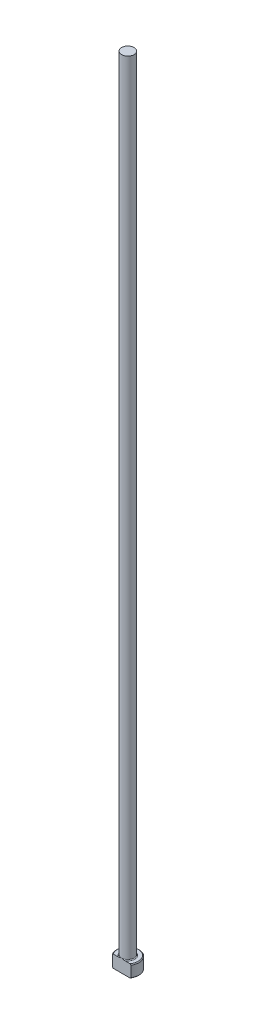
from build123d import *

# Parameters (mm, degrees)
CHAMFER1_SIZE = 0.254
FILLET1_R     = 0.254
KEY_DEPTH     = 255.050135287


with BuildPart() as part:
    # Sketch1 → Revolve1 (revolve)
    with BuildSketch(Plane.XY, mode=Mode.PRIVATE) as revolve1_sk:
        Polygon((0, 0), (-3.5687, 0), (-3.5687, 3.9624), (-1.98374, 3.9624), (-1.98374, 254), (0, 254), align=None)
    revolve(revolve1_sk.sketch.rotate(Axis((0, 259.958771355, 0), (0, -1, 0)), 270), axis=Axis((0, 259.958771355, 0), (0, -1, 0)))

    # Chamfer1
    chamfer1_edges = [part.edges().sort_by_distance(p)[0] for p in [
        (0, 3.9624, -3.5687),
        (0, 0, -3.5687),
    ]]
    chamfer(chamfer1_edges, length=CHAMFER1_SIZE)

    # Fillet1
    fillet1_edges = [part.edges().sort_by_distance(p)[0] for p in [
        (0, 3.9624, -1.98374),
    ]]
    fillet(fillet1_edges, radius=FILLET1_R)

    # Sketch2 → KEY (cut, through all)
    with BuildSketch(Plane.XZ):
        with BuildLine():
            Line((-2.966546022, 1.98374), (2.966546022, 1.98374))
            ThreePointArc((2.966546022, 1.98374), (0, 3.5687), (-2.966546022, 1.98374))
        make_face()
    extrude(amount=-KEY_DEPTH, mode=Mode.SUBTRACT)


solid = part.part
